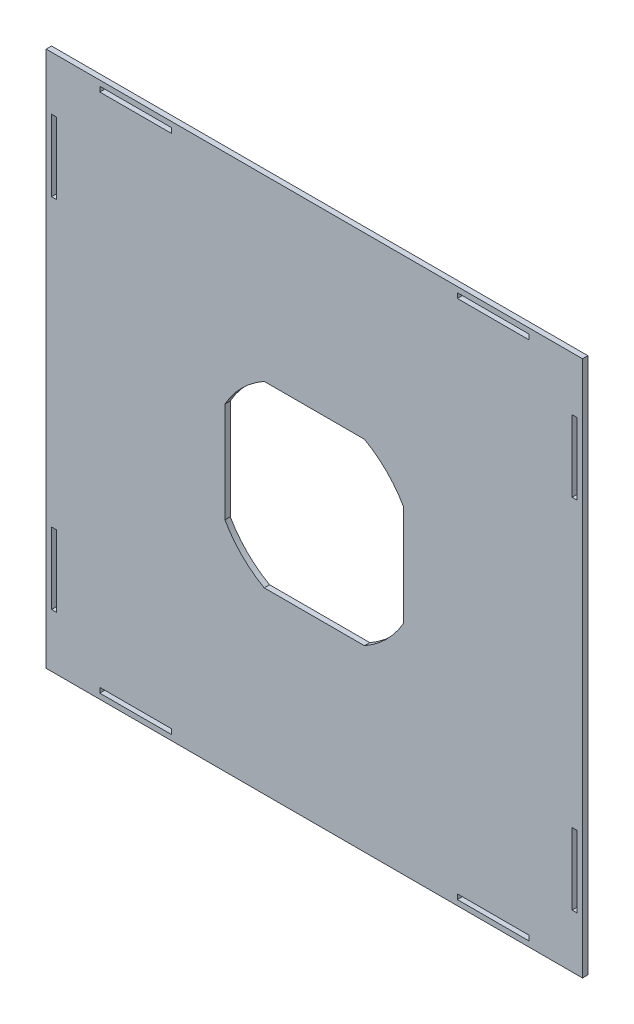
from build123d import *

# Parameters (mm, degrees)
CROQUIS1_W              = 300
CROQUIS1_H              = 300
CROQUIS1_W_2            = 40
CROQUIS1_H_2            = 2.8
CROQUIS1_W_3            = 2.8
CROQUIS1_H_3            = 40
SALIENTE_EXTRUIR1_DEPTH = 3
CORTAR_EXTRUIR1_DEPTH   = 10


with BuildPart() as part:
    # Croquis1 → Saliente-Extruir1 (new body)
    with BuildSketch(Plane.XY):
        Rectangle(CROQUIS1_W, CROQUIS1_H)
        with Locations((-100, -145.6)):
            Rectangle(CROQUIS1_W_2, CROQUIS1_H_2, mode=Mode.SUBTRACT)
        with Locations((100, -145.6)):
            Rectangle(CROQUIS1_W_2, CROQUIS1_H_2, mode=Mode.SUBTRACT)
        with Locations((-145.6, 100)):
            Rectangle(CROQUIS1_W_3, CROQUIS1_H_3, mode=Mode.SUBTRACT)
        with Locations((-145.6, -100)):
            Rectangle(CROQUIS1_W_3, CROQUIS1_H_3, mode=Mode.SUBTRACT)
        with Locations((100, 145.6)):
            Rectangle(CROQUIS1_W_2, CROQUIS1_H_2, mode=Mode.SUBTRACT)
        with Locations((-100, 145.6)):
            Rectangle(CROQUIS1_W_2, CROQUIS1_H_2, mode=Mode.SUBTRACT)
        with Locations((145.6, -100)):
            Rectangle(CROQUIS1_W_3, CROQUIS1_H_3, mode=Mode.SUBTRACT)
        with Locations((145.6, 100)):
            Rectangle(CROQUIS1_W_3, CROQUIS1_H_3, mode=Mode.SUBTRACT)
    extrude(amount=SALIENTE_EXTRUIR1_DEPTH)

    # Croquis2 → Cortar-Extruir1 (cut)
    with BuildSketch(Plane.XY.offset(3)):
        with BuildLine():
            Line((-28.043502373, -50), (28.043502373, -50))
            ThreePointArc((28.043502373, -50), (40.536637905, -40.536637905), (50, -28.043502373))
            Line((50, -28.043502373), (50, 28.043502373))
            ThreePointArc((50, 28.043502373), (40.536637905, 40.536637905), (28.043502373, 50))
            Line((28.043502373, 50), (-28.043502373, 50))
            ThreePointArc((-28.043502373, 50), (-40.536637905, 40.536637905), (-50, 28.043502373))
            Line((-50, 28.043502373), (-50, -28.043502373))
            ThreePointArc((-50, -28.043502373), (-40.536637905, -40.536637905), (-28.043502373, -50))
        make_face()
    extrude(amount=-CORTAR_EXTRUIR1_DEPTH, mode=Mode.SUBTRACT)


solid = part.part
